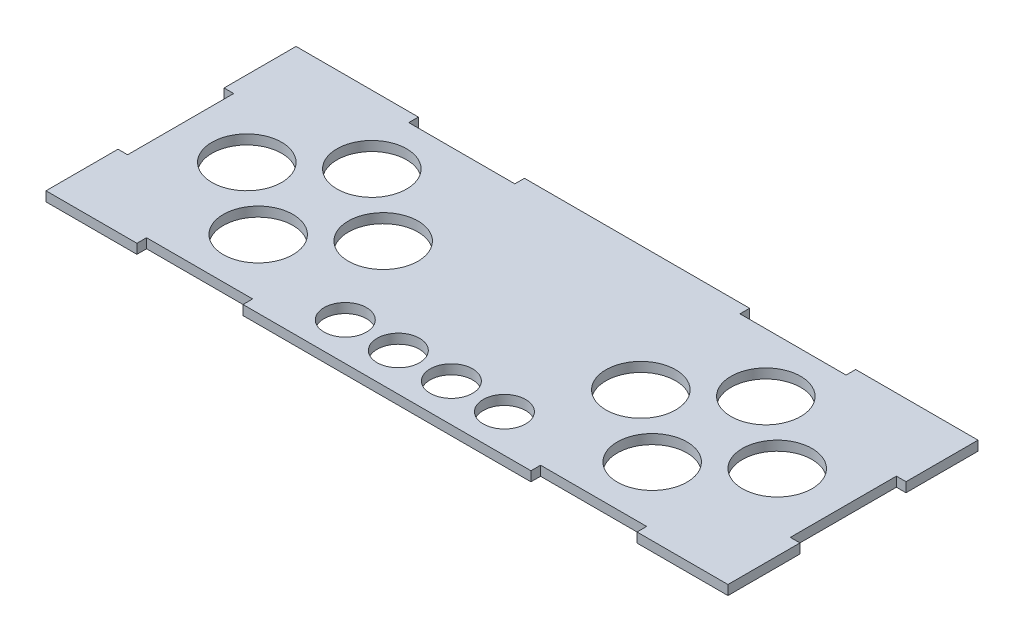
ISO-10303-21;
HEADER;
FILE_DESCRIPTION(('STEP AP214'),'2;1');
FILE_NAME('part.step','',(''),(''),'','','');
FILE_SCHEMA(('AUTOMOTIVE_DESIGN { 1 0 10303 214 1 1 1 1 }'));
ENDSEC;
DATA;
#1=APPLICATION_CONTEXT('core data for automotive mechanical design processes');
#2=APPLICATION_PROTOCOL_DEFINITION('international standard','automotive_design',2000,#1);
#3=PRODUCT_CONTEXT('',#1,'mechanical');
#4=PRODUCT('Part','Part','',(#3));
#5=PRODUCT_RELATED_PRODUCT_CATEGORY('part','',(#4));
#6=PRODUCT_DEFINITION_FORMATION('','',#4);
#7=PRODUCT_DEFINITION_CONTEXT('part definition',#1,'design');
#8=PRODUCT_DEFINITION('design','',#6,#7);
#9=PRODUCT_DEFINITION_SHAPE('','',#8);
#10=(LENGTH_UNIT() NAMED_UNIT(*) SI_UNIT(.MILLI.,.METRE.));
#11=(NAMED_UNIT(*) PLANE_ANGLE_UNIT() SI_UNIT($,.RADIAN.));
#12=(NAMED_UNIT(*) SI_UNIT($,.STERADIAN.) SOLID_ANGLE_UNIT());
#13=UNCERTAINTY_MEASURE_WITH_UNIT(LENGTH_MEASURE(1.E-05),#10,'distance_accuracy_value','');
#14=(GEOMETRIC_REPRESENTATION_CONTEXT(3) GLOBAL_UNCERTAINTY_ASSIGNED_CONTEXT((#13)) GLOBAL_UNIT_ASSIGNED_CONTEXT((#10,
#11,#12)) REPRESENTATION_CONTEXT('',''));
#15=CARTESIAN_POINT('',(0.,0.,0.));
#16=DIRECTION('',(0.,0.,1.));
#17=DIRECTION('',(1.,0.,0.));
#18=AXIS2_PLACEMENT_3D('',#15,#16,#17);
#19=CARTESIAN_POINT('',(0.,6.35,0.));
#20=DIRECTION('',(0.,-1.,0.));
#21=DIRECTION('',(0.,0.,-1.));
#22=AXIS2_PLACEMENT_3D('',#19,#20,#21);
#23=PLANE('',#22);
#24=DIRECTION('',(-1.,0.,0.));
#25=VECTOR('',#24,1.);
#26=CARTESIAN_POINT('',(-144.275,6.35,-82.5));
#27=LINE('',#26,#25);
#28=CARTESIAN_POINT('',(-144.275,6.35,-82.5));
#29=VERTEX_POINT('',#28);
#30=CARTESIAN_POINT('',(-225.,6.35,-82.5));
#31=VERTEX_POINT('',#30);
#32=EDGE_CURVE('E309',#29,#31,#27,.T.);
#33=ORIENTED_EDGE('',*,*,#32,.T.);
#34=DIRECTION('',(0.,0.,1.));
#35=VECTOR('',#34,1.);
#36=CARTESIAN_POINT('',(-225.,6.35,-35.));
#37=LINE('',#36,#35);
#38=CARTESIAN_POINT('',(-225.,6.35,-35.));
#39=VERTEX_POINT('',#38);
#40=EDGE_CURVE('E157',#31,#39,#37,.T.);
#41=ORIENTED_EDGE('',*,*,#40,.T.);
#42=DIRECTION('',(1.,0.,0.));
#43=VECTOR('',#42,1.);
#44=CARTESIAN_POINT('',(-225.,6.35,-35.));
#45=LINE('',#44,#43);
#46=CARTESIAN_POINT('',(-218.65,6.35,-35.));
#47=VERTEX_POINT('',#46);
#48=EDGE_CURVE('E384',#39,#47,#45,.T.);
#49=ORIENTED_EDGE('',*,*,#48,.T.);
#50=DIRECTION('',(0.,0.,1.));
#51=VECTOR('',#50,1.);
#52=CARTESIAN_POINT('',(-218.65,6.35,35.));
#53=LINE('',#52,#51);
#54=CARTESIAN_POINT('',(-218.65,6.35,35.));
#55=VERTEX_POINT('',#54);
#56=EDGE_CURVE('E403',#47,#55,#53,.T.);
#57=ORIENTED_EDGE('',*,*,#56,.T.);
#58=DIRECTION('',(-1.,0.,0.));
#59=VECTOR('',#58,1.);
#60=CARTESIAN_POINT('',(-225.,6.35,35.));
#61=LINE('',#60,#59);
#62=CARTESIAN_POINT('',(-225.,6.35,35.));
#63=VERTEX_POINT('',#62);
#64=EDGE_CURVE('E400',#55,#63,#61,.T.);
#65=ORIENTED_EDGE('',*,*,#64,.T.);
#66=DIRECTION('',(0.,0.,1.));
#67=VECTOR('',#66,1.);
#68=CARTESIAN_POINT('',(-225.,6.35,82.5));
#69=LINE('',#68,#67);
#70=CARTESIAN_POINT('',(-225.,6.35,82.5));
#71=VERTEX_POINT('',#70);
#72=EDGE_CURVE('E402',#63,#71,#69,.T.);
#73=ORIENTED_EDGE('',*,*,#72,.T.);
#74=DIRECTION('',(1.,0.,0.));
#75=VECTOR('',#74,1.);
#76=CARTESIAN_POINT('',(-165.,6.35,82.5));
#77=LINE('',#76,#75);
#78=CARTESIAN_POINT('',(-165.,6.35,82.5));
#79=VERTEX_POINT('',#78);
#80=EDGE_CURVE('E405',#71,#79,#77,.T.);
#81=ORIENTED_EDGE('',*,*,#80,.T.);
#82=DIRECTION('',(0.,0.,-1.));
#83=VECTOR('',#82,1.);
#84=CARTESIAN_POINT('',(-165.,6.35,82.5));
#85=LINE('',#84,#83);
#86=CARTESIAN_POINT('',(-165.,6.35,76.15));
#87=VERTEX_POINT('',#86);
#88=EDGE_CURVE('E411',#79,#87,#85,.T.);
#89=ORIENTED_EDGE('',*,*,#88,.T.);
#90=DIRECTION('',(1.,0.,0.));
#91=VECTOR('',#90,1.);
#92=CARTESIAN_POINT('',(-165.,6.35,76.15));
#93=LINE('',#92,#91);
#94=CARTESIAN_POINT('',(-95.,6.35,76.15));
#95=VERTEX_POINT('',#94);
#96=EDGE_CURVE('E413',#87,#95,#93,.T.);
#97=ORIENTED_EDGE('',*,*,#96,.T.);
#98=DIRECTION('',(0.,0.,1.));
#99=VECTOR('',#98,1.);
#100=CARTESIAN_POINT('',(-95.,6.35,82.5));
#101=LINE('',#100,#99);
#102=CARTESIAN_POINT('',(-95.,6.35,82.5));
#103=VERTEX_POINT('',#102);
#104=EDGE_CURVE('E415',#95,#103,#101,.T.);
#105=ORIENTED_EDGE('',*,*,#104,.T.);
#106=DIRECTION('',(1.,0.,0.));
#107=VECTOR('',#106,1.);
#108=CARTESIAN_POINT('',(95.,6.35,82.5));
#109=LINE('',#108,#107);
#110=CARTESIAN_POINT('',(95.,6.35,82.5));
#111=VERTEX_POINT('',#110);
#112=EDGE_CURVE('E417',#103,#111,#109,.T.);
#113=ORIENTED_EDGE('',*,*,#112,.T.);
#114=DIRECTION('',(0.,0.,-1.));
#115=VECTOR('',#114,1.);
#116=CARTESIAN_POINT('',(95.,6.35,82.5));
#117=LINE('',#116,#115);
#118=CARTESIAN_POINT('',(94.9999999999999,6.35,76.15));
#119=VERTEX_POINT('',#118);
#120=EDGE_CURVE('E419',#111,#119,#117,.T.);
#121=ORIENTED_EDGE('',*,*,#120,.T.);
#122=DIRECTION('',(1.,0.,0.));
#123=VECTOR('',#122,1.);
#124=CARTESIAN_POINT('',(94.9999999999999,6.35,76.15));
#125=LINE('',#124,#123);
#126=CARTESIAN_POINT('',(165.,6.35,76.15));
#127=VERTEX_POINT('',#126);
#128=EDGE_CURVE('E421',#119,#127,#125,.T.);
#129=ORIENTED_EDGE('',*,*,#128,.T.);
#130=DIRECTION('',(0.,0.,1.));
#131=VECTOR('',#130,1.);
#132=CARTESIAN_POINT('',(165.,6.35,82.5));
#133=LINE('',#132,#131);
#134=CARTESIAN_POINT('',(165.,6.35,82.5));
#135=VERTEX_POINT('',#134);
#136=EDGE_CURVE('E423',#127,#135,#133,.T.);
#137=ORIENTED_EDGE('',*,*,#136,.T.);
#138=DIRECTION('',(1.,0.,0.));
#139=VECTOR('',#138,1.);
#140=CARTESIAN_POINT('',(225.,6.35,82.5));
#141=LINE('',#140,#139);
#142=CARTESIAN_POINT('',(225.,6.35,82.5));
#143=VERTEX_POINT('',#142);
#144=EDGE_CURVE('E425',#135,#143,#141,.T.);
#145=ORIENTED_EDGE('',*,*,#144,.T.);
#146=DIRECTION('',(0.,0.,-1.));
#147=VECTOR('',#146,1.);
#148=CARTESIAN_POINT('',(225.,6.35,82.5));
#149=LINE('',#148,#147);
#150=CARTESIAN_POINT('',(225.,6.35,35.));
#151=VERTEX_POINT('',#150);
#152=EDGE_CURVE('E427',#143,#151,#149,.T.);
#153=ORIENTED_EDGE('',*,*,#152,.T.);
#154=DIRECTION('',(-1.,0.,0.));
#155=VECTOR('',#154,1.);
#156=CARTESIAN_POINT('',(225.,6.35,35.));
#157=LINE('',#156,#155);
#158=CARTESIAN_POINT('',(218.65,6.35,35.));
#159=VERTEX_POINT('',#158);
#160=EDGE_CURVE('E429',#151,#159,#157,.T.);
#161=ORIENTED_EDGE('',*,*,#160,.T.);
#162=DIRECTION('',(0.,0.,-1.));
#163=VECTOR('',#162,1.);
#164=CARTESIAN_POINT('',(218.65,6.35,35.));
#165=LINE('',#164,#163);
#166=CARTESIAN_POINT('',(218.65,6.35,-35.));
#167=VERTEX_POINT('',#166);
#168=EDGE_CURVE('E431',#159,#167,#165,.T.);
#169=ORIENTED_EDGE('',*,*,#168,.T.);
#170=DIRECTION('',(1.,0.,0.));
#171=VECTOR('',#170,1.);
#172=CARTESIAN_POINT('',(225.,6.35,-35.));
#173=LINE('',#172,#171);
#174=CARTESIAN_POINT('',(225.,6.35,-35.));
#175=VERTEX_POINT('',#174);
#176=EDGE_CURVE('E433',#167,#175,#173,.T.);
#177=ORIENTED_EDGE('',*,*,#176,.T.);
#178=DIRECTION('',(0.,0.,-1.));
#179=VECTOR('',#178,1.);
#180=CARTESIAN_POINT('',(225.,6.35,-35.));
#181=LINE('',#180,#179);
#182=CARTESIAN_POINT('',(225.,6.35,-82.5));
#183=VERTEX_POINT('',#182);
#184=EDGE_CURVE('E435',#175,#183,#181,.T.);
#185=ORIENTED_EDGE('',*,*,#184,.T.);
#186=DIRECTION('',(-1.,0.,0.));
#187=VECTOR('',#186,1.);
#188=CARTESIAN_POINT('',(225.,6.35,-82.5));
#189=LINE('',#188,#187);
#190=CARTESIAN_POINT('',(144.275,6.35,-82.5));
#191=VERTEX_POINT('',#190);
#192=EDGE_CURVE('E437',#183,#191,#189,.T.);
#193=ORIENTED_EDGE('',*,*,#192,.T.);
#194=DIRECTION('',(0.,0.,1.));
#195=VECTOR('',#194,1.);
#196=CARTESIAN_POINT('',(144.275,6.35,-82.5));
#197=LINE('',#196,#195);
#198=CARTESIAN_POINT('',(144.275,6.35,-76.15));
#199=VERTEX_POINT('',#198);
#200=EDGE_CURVE('E439',#191,#199,#197,.T.);
#201=ORIENTED_EDGE('',*,*,#200,.T.);
#202=DIRECTION('',(-1.,0.,0.));
#203=VECTOR('',#202,1.);
#204=CARTESIAN_POINT('',(74.275,6.35,-76.15));
#205=LINE('',#204,#203);
#206=CARTESIAN_POINT('',(74.275,6.35,-76.15));
#207=VERTEX_POINT('',#206);
#208=EDGE_CURVE('E441',#199,#207,#205,.T.);
#209=ORIENTED_EDGE('',*,*,#208,.T.);
#210=DIRECTION('',(0.,0.,-1.));
#211=VECTOR('',#210,1.);
#212=CARTESIAN_POINT('',(74.275,6.35,-82.5));
#213=LINE('',#212,#211);
#214=CARTESIAN_POINT('',(74.275,6.35,-82.5));
#215=VERTEX_POINT('',#214);
#216=EDGE_CURVE('E443',#207,#215,#213,.T.);
#217=ORIENTED_EDGE('',*,*,#216,.T.);
#218=DIRECTION('',(-1.,0.,0.));
#219=VECTOR('',#218,1.);
#220=CARTESIAN_POINT('',(74.275,6.35,-82.5));
#221=LINE('',#220,#219);
#222=CARTESIAN_POINT('',(-74.275,6.35,-82.5));
#223=VERTEX_POINT('',#222);
#224=EDGE_CURVE('E236',#215,#223,#221,.T.);
#225=ORIENTED_EDGE('',*,*,#224,.T.);
#226=DIRECTION('',(0.,0.,1.));
#227=VECTOR('',#226,1.);
#228=CARTESIAN_POINT('',(-74.275,6.35,-82.5));
#229=LINE('',#228,#227);
#230=CARTESIAN_POINT('',(-74.275,6.35,-76.15));
#231=VERTEX_POINT('',#230);
#232=EDGE_CURVE('E230',#223,#231,#229,.T.);
#233=ORIENTED_EDGE('',*,*,#232,.T.);
#234=DIRECTION('',(-1.,0.,0.));
#235=VECTOR('',#234,1.);
#236=CARTESIAN_POINT('',(-144.275,6.35,-76.15));
#237=LINE('',#236,#235);
#238=CARTESIAN_POINT('',(-144.275,6.35,-76.15));
#239=VERTEX_POINT('',#238);
#240=EDGE_CURVE('E234',#231,#239,#237,.T.);
#241=ORIENTED_EDGE('',*,*,#240,.T.);
#242=DIRECTION('',(0.,0.,-1.));
#243=VECTOR('',#242,1.);
#244=CARTESIAN_POINT('',(-144.275,6.35,-82.5));
#245=LINE('',#244,#243);
#246=EDGE_CURVE('E54',#239,#29,#245,.T.);
#247=ORIENTED_EDGE('',*,*,#246,.T.);
#248=EDGE_LOOP('',(#33,#41,#49,#57,#65,#73,#81,#89,#97,#105,#113,#121,#129,#137,#145,#153,#161,
#169,#177,#185,#193,#201,#209,#217,#225,#233,#241,#247));
#249=FACE_BOUND('',#248,.T.);
#250=CARTESIAN_POINT('',(-130.,6.35,-37.5));
#251=DIRECTION('',(0.,1.,0.));
#252=DIRECTION('',(0.,0.,1.));
#253=AXIS2_PLACEMENT_3D('',#250,#251,#252);
#254=CIRCLE('',#253,23.);
#255=CARTESIAN_POINT('',(-130.,6.35,-14.5));
#256=VERTEX_POINT('',#255);
#257=EDGE_CURVE('E258',#256,#256,#254,.T.);
#258=ORIENTED_EDGE('',*,*,#257,.F.);
#259=EDGE_LOOP('',(#258));
#260=FACE_BOUND('',#259,.T.);
#261=CARTESIAN_POINT('',(-85.,6.35,0.));
#262=DIRECTION('',(0.,1.,0.));
#263=DIRECTION('',(0.,0.,1.));
#264=AXIS2_PLACEMENT_3D('',#261,#262,#263);
#265=CIRCLE('',#264,23.);
#266=CARTESIAN_POINT('',(-85.,6.35,23.));
#267=VERTEX_POINT('',#266);
#268=EDGE_CURVE('E587',#267,#267,#265,.T.);
#269=ORIENTED_EDGE('',*,*,#268,.F.);
#270=EDGE_LOOP('',(#269));
#271=FACE_BOUND('',#270,.T.);
#272=CARTESIAN_POINT('',(-175.,6.35,0.));
#273=DIRECTION('',(0.,1.,0.));
#274=DIRECTION('',(0.,0.,1.));
#275=AXIS2_PLACEMENT_3D('',#272,#273,#274);
#276=CIRCLE('',#275,23.);
#277=CARTESIAN_POINT('',(-175.,6.35,23.));
#278=VERTEX_POINT('',#277);
#279=EDGE_CURVE('E581',#278,#278,#276,.T.);
#280=ORIENTED_EDGE('',*,*,#279,.F.);
#281=EDGE_LOOP('',(#280));
#282=FACE_BOUND('',#281,.T.);
#283=CARTESIAN_POINT('',(-130.,6.35,37.5));
#284=DIRECTION('',(0.,1.,0.));
#285=DIRECTION('',(0.,0.,1.));
#286=AXIS2_PLACEMENT_3D('',#283,#284,#285);
#287=CIRCLE('',#286,23.);
#288=CARTESIAN_POINT('',(-130.,6.35,60.5));
#289=VERTEX_POINT('',#288);
#290=EDGE_CURVE('E575',#289,#289,#287,.T.);
#291=ORIENTED_EDGE('',*,*,#290,.F.);
#292=EDGE_LOOP('',(#291));
#293=FACE_BOUND('',#292,.T.);
#294=CARTESIAN_POINT('',(130.,6.35,-37.5));
#295=DIRECTION('',(0.,1.,0.));
#296=DIRECTION('',(0.,0.,1.));
#297=AXIS2_PLACEMENT_3D('',#294,#295,#296);
#298=CIRCLE('',#297,23.);
#299=CARTESIAN_POINT('',(130.,6.35,-14.5000000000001));
#300=VERTEX_POINT('',#299);
#301=EDGE_CURVE('E569',#300,#300,#298,.T.);
#302=ORIENTED_EDGE('',*,*,#301,.F.);
#303=EDGE_LOOP('',(#302));
#304=FACE_BOUND('',#303,.T.);
#305=CARTESIAN_POINT('',(85.,6.35,0.));
#306=DIRECTION('',(0.,1.,0.));
#307=DIRECTION('',(0.,0.,1.));
#308=AXIS2_PLACEMENT_3D('',#305,#306,#307);
#309=CIRCLE('',#308,23.);
#310=CARTESIAN_POINT('',(85.,6.35,23.));
#311=VERTEX_POINT('',#310);
#312=EDGE_CURVE('E563',#311,#311,#309,.T.);
#313=ORIENTED_EDGE('',*,*,#312,.F.);
#314=EDGE_LOOP('',(#313));
#315=FACE_BOUND('',#314,.T.);
#316=CARTESIAN_POINT('',(175.,6.35,0.));
#317=DIRECTION('',(0.,1.,0.));
#318=DIRECTION('',(0.,0.,1.));
#319=AXIS2_PLACEMENT_3D('',#316,#317,#318);
#320=CIRCLE('',#319,23.);
#321=CARTESIAN_POINT('',(175.,6.35,23.));
#322=VERTEX_POINT('',#321);
#323=EDGE_CURVE('E557',#322,#322,#320,.T.);
#324=ORIENTED_EDGE('',*,*,#323,.F.);
#325=EDGE_LOOP('',(#324));
#326=FACE_BOUND('',#325,.T.);
#327=CARTESIAN_POINT('',(130.,6.35,37.5));
#328=DIRECTION('',(0.,1.,0.));
#329=DIRECTION('',(0.,0.,1.));
#330=AXIS2_PLACEMENT_3D('',#327,#328,#329);
#331=CIRCLE('',#330,23.);
#332=CARTESIAN_POINT('',(130.,6.35,60.5));
#333=VERTEX_POINT('',#332);
#334=EDGE_CURVE('E551',#333,#333,#331,.T.);
#335=ORIENTED_EDGE('',*,*,#334,.F.);
#336=EDGE_LOOP('',(#335));
#337=FACE_BOUND('',#336,.T.);
#338=CARTESIAN_POINT('',(-52.5,6.35,57.5));
#339=DIRECTION('',(0.,1.,0.));
#340=DIRECTION('',(0.,0.,1.));
#341=AXIS2_PLACEMENT_3D('',#338,#339,#340);
#342=CIRCLE('',#341,14.);
#343=CARTESIAN_POINT('',(-52.5,6.35,71.5));
#344=VERTEX_POINT('',#343);
#345=EDGE_CURVE('E545',#344,#344,#342,.T.);
#346=ORIENTED_EDGE('',*,*,#345,.F.);
#347=EDGE_LOOP('',(#346));
#348=FACE_BOUND('',#347,.T.);
#349=CARTESIAN_POINT('',(-17.5,6.35,57.5));
#350=DIRECTION('',(0.,1.,0.));
#351=DIRECTION('',(0.,0.,1.));
#352=AXIS2_PLACEMENT_3D('',#349,#350,#351);
#353=CIRCLE('',#352,14.);
#354=CARTESIAN_POINT('',(-17.5,6.35,71.5));
#355=VERTEX_POINT('',#354);
#356=EDGE_CURVE('E539',#355,#355,#353,.T.);
#357=ORIENTED_EDGE('',*,*,#356,.F.);
#358=EDGE_LOOP('',(#357));
#359=FACE_BOUND('',#358,.T.);
#360=CARTESIAN_POINT('',(17.5,6.35,57.5));
#361=DIRECTION('',(0.,1.,0.));
#362=DIRECTION('',(0.,0.,1.));
#363=AXIS2_PLACEMENT_3D('',#360,#361,#362);
#364=CIRCLE('',#363,14.);
#365=CARTESIAN_POINT('',(17.5,6.35,71.5));
#366=VERTEX_POINT('',#365);
#367=EDGE_CURVE('E533',#366,#366,#364,.T.);
#368=ORIENTED_EDGE('',*,*,#367,.F.);
#369=EDGE_LOOP('',(#368));
#370=FACE_BOUND('',#369,.T.);
#371=CARTESIAN_POINT('',(52.5,6.35,57.5));
#372=DIRECTION('',(0.,1.,0.));
#373=DIRECTION('',(0.,0.,1.));
#374=AXIS2_PLACEMENT_3D('',#371,#372,#373);
#375=CIRCLE('',#374,14.);
#376=CARTESIAN_POINT('',(52.5,6.35,71.5));
#377=VERTEX_POINT('',#376);
#378=EDGE_CURVE('E524',#377,#377,#375,.T.);
#379=ORIENTED_EDGE('',*,*,#378,.F.);
#380=EDGE_LOOP('',(#379));
#381=FACE_BOUND('',#380,.T.);
#382=ADVANCED_FACE('F37',(#249,#260,#271,#282,#293,#304,#315,#326,#337,#348,#359,#370,#381),#23,.F.);
#383=CARTESIAN_POINT('',(0.,0.,0.));
#384=DIRECTION('',(0.,-1.,0.));
#385=DIRECTION('',(0.,0.,-1.));
#386=AXIS2_PLACEMENT_3D('',#383,#384,#385);
#387=PLANE('',#386);
#388=CARTESIAN_POINT('',(17.5,0.,57.5));
#389=DIRECTION('',(0.,1.,0.));
#390=DIRECTION('',(0.,0.,1.));
#391=AXIS2_PLACEMENT_3D('',#388,#389,#390);
#392=CIRCLE('',#391,14.);
#393=CARTESIAN_POINT('',(17.5,0.,71.5));
#394=VERTEX_POINT('',#393);
#395=EDGE_CURVE('E530',#394,#394,#392,.T.);
#396=ORIENTED_EDGE('',*,*,#395,.T.);
#397=EDGE_LOOP('',(#396));
#398=FACE_BOUND('',#397,.T.);
#399=CARTESIAN_POINT('',(-52.5,0.,57.5));
#400=DIRECTION('',(0.,1.,0.));
#401=DIRECTION('',(0.,0.,1.));
#402=AXIS2_PLACEMENT_3D('',#399,#400,#401);
#403=CIRCLE('',#402,14.);
#404=CARTESIAN_POINT('',(-52.5,0.,71.5));
#405=VERTEX_POINT('',#404);
#406=EDGE_CURVE('E542',#405,#405,#403,.T.);
#407=ORIENTED_EDGE('',*,*,#406,.T.);
#408=EDGE_LOOP('',(#407));
#409=FACE_BOUND('',#408,.T.);
#410=CARTESIAN_POINT('',(175.,0.,0.));
#411=DIRECTION('',(0.,1.,0.));
#412=DIRECTION('',(0.,0.,1.));
#413=AXIS2_PLACEMENT_3D('',#410,#411,#412);
#414=CIRCLE('',#413,23.);
#415=CARTESIAN_POINT('',(175.,0.,23.));
#416=VERTEX_POINT('',#415);
#417=EDGE_CURVE('E554',#416,#416,#414,.T.);
#418=ORIENTED_EDGE('',*,*,#417,.T.);
#419=EDGE_LOOP('',(#418));
#420=FACE_BOUND('',#419,.T.);
#421=CARTESIAN_POINT('',(130.,0.,-37.5));
#422=DIRECTION('',(0.,1.,0.));
#423=DIRECTION('',(0.,0.,1.));
#424=AXIS2_PLACEMENT_3D('',#421,#422,#423);
#425=CIRCLE('',#424,23.);
#426=CARTESIAN_POINT('',(130.,0.,-14.5000000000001));
#427=VERTEX_POINT('',#426);
#428=EDGE_CURVE('E566',#427,#427,#425,.T.);
#429=ORIENTED_EDGE('',*,*,#428,.T.);
#430=EDGE_LOOP('',(#429));
#431=FACE_BOUND('',#430,.T.);
#432=CARTESIAN_POINT('',(-175.,0.,0.));
#433=DIRECTION('',(0.,1.,0.));
#434=DIRECTION('',(0.,0.,1.));
#435=AXIS2_PLACEMENT_3D('',#432,#433,#434);
#436=CIRCLE('',#435,23.);
#437=CARTESIAN_POINT('',(-175.,0.,23.));
#438=VERTEX_POINT('',#437);
#439=EDGE_CURVE('E578',#438,#438,#436,.T.);
#440=ORIENTED_EDGE('',*,*,#439,.T.);
#441=EDGE_LOOP('',(#440));
#442=FACE_BOUND('',#441,.T.);
#443=CARTESIAN_POINT('',(-130.,0.,-37.5));
#444=DIRECTION('',(0.,1.,0.));
#445=DIRECTION('',(0.,0.,1.));
#446=AXIS2_PLACEMENT_3D('',#443,#444,#445);
#447=CIRCLE('',#446,23.);
#448=CARTESIAN_POINT('',(-130.,0.,-14.5));
#449=VERTEX_POINT('',#448);
#450=EDGE_CURVE('E590',#449,#449,#447,.T.);
#451=ORIENTED_EDGE('',*,*,#450,.T.);
#452=EDGE_LOOP('',(#451));
#453=FACE_BOUND('',#452,.T.);
#454=DIRECTION('',(-1.,0.,0.));
#455=VECTOR('',#454,1.);
#456=CARTESIAN_POINT('',(-144.275,0.,-82.5));
#457=LINE('',#456,#455);
#458=CARTESIAN_POINT('',(-144.275,0.,-82.5));
#459=VERTEX_POINT('',#458);
#460=CARTESIAN_POINT('',(-225.,0.,-82.5));
#461=VERTEX_POINT('',#460);
#462=EDGE_CURVE('E254',#459,#461,#457,.T.);
#463=ORIENTED_EDGE('',*,*,#462,.F.);
#464=DIRECTION('',(0.,0.,-1.));
#465=VECTOR('',#464,1.);
#466=CARTESIAN_POINT('',(-144.275,0.,-82.5));
#467=LINE('',#466,#465);
#468=CARTESIAN_POINT('',(-144.275,0.,-76.15));
#469=VERTEX_POINT('',#468);
#470=EDGE_CURVE('E149',#469,#459,#467,.T.);
#471=ORIENTED_EDGE('',*,*,#470,.F.);
#472=DIRECTION('',(-1.,0.,0.));
#473=VECTOR('',#472,1.);
#474=CARTESIAN_POINT('',(-144.275,0.,-76.15));
#475=LINE('',#474,#473);
#476=CARTESIAN_POINT('',(-74.275,0.,-76.15));
#477=VERTEX_POINT('',#476);
#478=EDGE_CURVE('E143',#477,#469,#475,.T.);
#479=ORIENTED_EDGE('',*,*,#478,.F.);
#480=DIRECTION('',(0.,0.,1.));
#481=VECTOR('',#480,1.);
#482=CARTESIAN_POINT('',(-74.275,0.,-82.5));
#483=LINE('',#482,#481);
#484=CARTESIAN_POINT('',(-74.275,0.,-82.5));
#485=VERTEX_POINT('',#484);
#486=EDGE_CURVE('E244',#485,#477,#483,.T.);
#487=ORIENTED_EDGE('',*,*,#486,.F.);
#488=DIRECTION('',(-1.,0.,0.));
#489=VECTOR('',#488,1.);
#490=CARTESIAN_POINT('',(74.275,0.,-82.5));
#491=LINE('',#490,#489);
#492=CARTESIAN_POINT('',(74.275,0.,-82.5));
#493=VERTEX_POINT('',#492);
#494=EDGE_CURVE('E304',#493,#485,#491,.T.);
#495=ORIENTED_EDGE('',*,*,#494,.F.);
#496=DIRECTION('',(0.,0.,-1.));
#497=VECTOR('',#496,1.);
#498=CARTESIAN_POINT('',(74.275,0.,-82.5));
#499=LINE('',#498,#497);
#500=CARTESIAN_POINT('',(74.275,0.,-76.15));
#501=VERTEX_POINT('',#500);
#502=EDGE_CURVE('E302',#501,#493,#499,.T.);
#503=ORIENTED_EDGE('',*,*,#502,.F.);
#504=DIRECTION('',(-1.,0.,0.));
#505=VECTOR('',#504,1.);
#506=CARTESIAN_POINT('',(74.275,0.,-76.15));
#507=LINE('',#506,#505);
#508=CARTESIAN_POINT('',(144.275,0.,-76.15));
#509=VERTEX_POINT('',#508);
#510=EDGE_CURVE('E300',#509,#501,#507,.T.);
#511=ORIENTED_EDGE('',*,*,#510,.F.);
#512=DIRECTION('',(0.,0.,1.));
#513=VECTOR('',#512,1.);
#514=CARTESIAN_POINT('',(144.275,0.,-82.5));
#515=LINE('',#514,#513);
#516=CARTESIAN_POINT('',(144.275,0.,-82.5));
#517=VERTEX_POINT('',#516);
#518=EDGE_CURVE('E298',#517,#509,#515,.T.);
#519=ORIENTED_EDGE('',*,*,#518,.F.);
#520=DIRECTION('',(-1.,0.,0.));
#521=VECTOR('',#520,1.);
#522=CARTESIAN_POINT('',(225.,0.,-82.5));
#523=LINE('',#522,#521);
#524=CARTESIAN_POINT('',(225.,0.,-82.5));
#525=VERTEX_POINT('',#524);
#526=EDGE_CURVE('E296',#525,#517,#523,.T.);
#527=ORIENTED_EDGE('',*,*,#526,.F.);
#528=DIRECTION('',(0.,0.,-1.));
#529=VECTOR('',#528,1.);
#530=CARTESIAN_POINT('',(225.,0.,-35.));
#531=LINE('',#530,#529);
#532=CARTESIAN_POINT('',(225.,0.,-35.));
#533=VERTEX_POINT('',#532);
#534=EDGE_CURVE('E294',#533,#525,#531,.T.);
#535=ORIENTED_EDGE('',*,*,#534,.F.);
#536=DIRECTION('',(1.,0.,0.));
#537=VECTOR('',#536,1.);
#538=CARTESIAN_POINT('',(225.,0.,-35.));
#539=LINE('',#538,#537);
#540=CARTESIAN_POINT('',(218.65,0.,-35.));
#541=VERTEX_POINT('',#540);
#542=EDGE_CURVE('E292',#541,#533,#539,.T.);
#543=ORIENTED_EDGE('',*,*,#542,.F.);
#544=DIRECTION('',(0.,0.,-1.));
#545=VECTOR('',#544,1.);
#546=CARTESIAN_POINT('',(218.65,0.,35.));
#547=LINE('',#546,#545);
#548=CARTESIAN_POINT('',(218.65,0.,35.));
#549=VERTEX_POINT('',#548);
#550=EDGE_CURVE('E290',#549,#541,#547,.T.);
#551=ORIENTED_EDGE('',*,*,#550,.F.);
#552=DIRECTION('',(-1.,0.,0.));
#553=VECTOR('',#552,1.);
#554=CARTESIAN_POINT('',(225.,0.,35.));
#555=LINE('',#554,#553);
#556=CARTESIAN_POINT('',(225.,0.,35.));
#557=VERTEX_POINT('',#556);
#558=EDGE_CURVE('E288',#557,#549,#555,.T.);
#559=ORIENTED_EDGE('',*,*,#558,.F.);
#560=DIRECTION('',(0.,0.,-1.));
#561=VECTOR('',#560,1.);
#562=CARTESIAN_POINT('',(225.,0.,82.5));
#563=LINE('',#562,#561);
#564=CARTESIAN_POINT('',(225.,0.,82.5));
#565=VERTEX_POINT('',#564);
#566=EDGE_CURVE('E286',#565,#557,#563,.T.);
#567=ORIENTED_EDGE('',*,*,#566,.F.);
#568=DIRECTION('',(1.,0.,0.));
#569=VECTOR('',#568,1.);
#570=CARTESIAN_POINT('',(225.,0.,82.5));
#571=LINE('',#570,#569);
#572=CARTESIAN_POINT('',(165.,0.,82.5));
#573=VERTEX_POINT('',#572);
#574=EDGE_CURVE('E284',#573,#565,#571,.T.);
#575=ORIENTED_EDGE('',*,*,#574,.F.);
#576=DIRECTION('',(0.,0.,1.));
#577=VECTOR('',#576,1.);
#578=CARTESIAN_POINT('',(165.,0.,82.5));
#579=LINE('',#578,#577);
#580=CARTESIAN_POINT('',(165.,0.,76.15));
#581=VERTEX_POINT('',#580);
#582=EDGE_CURVE('E282',#581,#573,#579,.T.);
#583=ORIENTED_EDGE('',*,*,#582,.F.);
#584=DIRECTION('',(1.,0.,0.));
#585=VECTOR('',#584,1.);
#586=CARTESIAN_POINT('',(94.9999999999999,0.,76.15));
#587=LINE('',#586,#585);
#588=CARTESIAN_POINT('',(94.9999999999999,0.,76.15));
#589=VERTEX_POINT('',#588);
#590=EDGE_CURVE('E280',#589,#581,#587,.T.);
#591=ORIENTED_EDGE('',*,*,#590,.F.);
#592=DIRECTION('',(0.,0.,-1.));
#593=VECTOR('',#592,1.);
#594=CARTESIAN_POINT('',(95.,0.,82.5));
#595=LINE('',#594,#593);
#596=CARTESIAN_POINT('',(95.,0.,82.5));
#597=VERTEX_POINT('',#596);
#598=EDGE_CURVE('E278',#597,#589,#595,.T.);
#599=ORIENTED_EDGE('',*,*,#598,.F.);
#600=DIRECTION('',(1.,0.,0.));
#601=VECTOR('',#600,1.);
#602=CARTESIAN_POINT('',(95.,0.,82.5));
#603=LINE('',#602,#601);
#604=CARTESIAN_POINT('',(-95.,0.,82.5));
#605=VERTEX_POINT('',#604);
#606=EDGE_CURVE('E276',#605,#597,#603,.T.);
#607=ORIENTED_EDGE('',*,*,#606,.F.);
#608=DIRECTION('',(0.,0.,1.));
#609=VECTOR('',#608,1.);
#610=CARTESIAN_POINT('',(-95.,0.,82.5));
#611=LINE('',#610,#609);
#612=CARTESIAN_POINT('',(-95.,0.,76.15));
#613=VERTEX_POINT('',#612);
#614=EDGE_CURVE('E274',#613,#605,#611,.T.);
#615=ORIENTED_EDGE('',*,*,#614,.F.);
#616=DIRECTION('',(1.,0.,0.));
#617=VECTOR('',#616,1.);
#618=CARTESIAN_POINT('',(-165.,0.,76.15));
#619=LINE('',#618,#617);
#620=CARTESIAN_POINT('',(-165.,0.,76.15));
#621=VERTEX_POINT('',#620);
#622=EDGE_CURVE('E272',#621,#613,#619,.T.);
#623=ORIENTED_EDGE('',*,*,#622,.F.);
#624=DIRECTION('',(0.,0.,-1.));
#625=VECTOR('',#624,1.);
#626=CARTESIAN_POINT('',(-165.,0.,82.5));
#627=LINE('',#626,#625);
#628=CARTESIAN_POINT('',(-165.,0.,82.5));
#629=VERTEX_POINT('',#628);
#630=EDGE_CURVE('E270',#629,#621,#627,.T.);
#631=ORIENTED_EDGE('',*,*,#630,.F.);
#632=DIRECTION('',(1.,0.,0.));
#633=VECTOR('',#632,1.);
#634=CARTESIAN_POINT('',(-165.,0.,82.5));
#635=LINE('',#634,#633);
#636=CARTESIAN_POINT('',(-225.,0.,82.5));
#637=VERTEX_POINT('',#636);
#638=EDGE_CURVE('E268',#637,#629,#635,.T.);
#639=ORIENTED_EDGE('',*,*,#638,.F.);
#640=DIRECTION('',(0.,0.,1.));
#641=VECTOR('',#640,1.);
#642=CARTESIAN_POINT('',(-225.,0.,82.5));
#643=LINE('',#642,#641);
#644=CARTESIAN_POINT('',(-225.,0.,35.));
#645=VERTEX_POINT('',#644);
#646=EDGE_CURVE('E266',#645,#637,#643,.T.);
#647=ORIENTED_EDGE('',*,*,#646,.F.);
#648=DIRECTION('',(-1.,0.,0.));
#649=VECTOR('',#648,1.);
#650=CARTESIAN_POINT('',(-225.,0.,35.));
#651=LINE('',#650,#649);
#652=CARTESIAN_POINT('',(-218.65,0.,35.));
#653=VERTEX_POINT('',#652);
#654=EDGE_CURVE('E264',#653,#645,#651,.T.);
#655=ORIENTED_EDGE('',*,*,#654,.F.);
#656=DIRECTION('',(0.,0.,1.));
#657=VECTOR('',#656,1.);
#658=CARTESIAN_POINT('',(-218.65,0.,35.));
#659=LINE('',#658,#657);
#660=CARTESIAN_POINT('',(-218.65,0.,-35.));
#661=VERTEX_POINT('',#660);
#662=EDGE_CURVE('E262',#661,#653,#659,.T.);
#663=ORIENTED_EDGE('',*,*,#662,.F.);
#664=DIRECTION('',(1.,0.,0.));
#665=VECTOR('',#664,1.);
#666=CARTESIAN_POINT('',(-225.,0.,-35.));
#667=LINE('',#666,#665);
#668=CARTESIAN_POINT('',(-225.,0.,-35.));
#669=VERTEX_POINT('',#668);
#670=EDGE_CURVE('E260',#669,#661,#667,.T.);
#671=ORIENTED_EDGE('',*,*,#670,.F.);
#672=DIRECTION('',(0.,0.,1.));
#673=VECTOR('',#672,1.);
#674=CARTESIAN_POINT('',(-225.,0.,-35.));
#675=LINE('',#674,#673);
#676=EDGE_CURVE('E257',#461,#669,#675,.T.);
#677=ORIENTED_EDGE('',*,*,#676,.F.);
#678=EDGE_LOOP('',(#463,#471,#479,#487,#495,#503,#511,#519,#527,#535,#543,#551,#559,#567,#575,
#583,#591,#599,#607,#615,#623,#631,#639,#647,#655,#663,#671,#677));
#679=FACE_BOUND('',#678,.T.);
#680=CARTESIAN_POINT('',(-85.,0.,0.));
#681=DIRECTION('',(0.,1.,0.));
#682=DIRECTION('',(0.,0.,1.));
#683=AXIS2_PLACEMENT_3D('',#680,#681,#682);
#684=CIRCLE('',#683,23.);
#685=CARTESIAN_POINT('',(-85.,0.,23.));
#686=VERTEX_POINT('',#685);
#687=EDGE_CURVE('E584',#686,#686,#684,.T.);
#688=ORIENTED_EDGE('',*,*,#687,.T.);
#689=EDGE_LOOP('',(#688));
#690=FACE_BOUND('',#689,.T.);
#691=CARTESIAN_POINT('',(-130.,0.,37.5));
#692=DIRECTION('',(0.,1.,0.));
#693=DIRECTION('',(0.,0.,1.));
#694=AXIS2_PLACEMENT_3D('',#691,#692,#693);
#695=CIRCLE('',#694,23.);
#696=CARTESIAN_POINT('',(-130.,0.,60.5));
#697=VERTEX_POINT('',#696);
#698=EDGE_CURVE('E572',#697,#697,#695,.T.);
#699=ORIENTED_EDGE('',*,*,#698,.T.);
#700=EDGE_LOOP('',(#699));
#701=FACE_BOUND('',#700,.T.);
#702=CARTESIAN_POINT('',(85.,0.,0.));
#703=DIRECTION('',(0.,1.,0.));
#704=DIRECTION('',(0.,0.,1.));
#705=AXIS2_PLACEMENT_3D('',#702,#703,#704);
#706=CIRCLE('',#705,23.);
#707=CARTESIAN_POINT('',(85.,0.,23.));
#708=VERTEX_POINT('',#707);
#709=EDGE_CURVE('E560',#708,#708,#706,.T.);
#710=ORIENTED_EDGE('',*,*,#709,.T.);
#711=EDGE_LOOP('',(#710));
#712=FACE_BOUND('',#711,.T.);
#713=CARTESIAN_POINT('',(130.,0.,37.5));
#714=DIRECTION('',(0.,1.,0.));
#715=DIRECTION('',(0.,0.,1.));
#716=AXIS2_PLACEMENT_3D('',#713,#714,#715);
#717=CIRCLE('',#716,23.);
#718=CARTESIAN_POINT('',(130.,0.,60.5));
#719=VERTEX_POINT('',#718);
#720=EDGE_CURVE('E548',#719,#719,#717,.T.);
#721=ORIENTED_EDGE('',*,*,#720,.T.);
#722=EDGE_LOOP('',(#721));
#723=FACE_BOUND('',#722,.T.);
#724=CARTESIAN_POINT('',(-17.5,0.,57.5));
#725=DIRECTION('',(0.,1.,0.));
#726=DIRECTION('',(0.,0.,1.));
#727=AXIS2_PLACEMENT_3D('',#724,#725,#726);
#728=CIRCLE('',#727,14.);
#729=CARTESIAN_POINT('',(-17.5,0.,71.5));
#730=VERTEX_POINT('',#729);
#731=EDGE_CURVE('E536',#730,#730,#728,.T.);
#732=ORIENTED_EDGE('',*,*,#731,.T.);
#733=EDGE_LOOP('',(#732));
#734=FACE_BOUND('',#733,.T.);
#735=CARTESIAN_POINT('',(52.5,0.,57.5));
#736=DIRECTION('',(0.,1.,0.));
#737=DIRECTION('',(0.,0.,1.));
#738=AXIS2_PLACEMENT_3D('',#735,#736,#737);
#739=CIRCLE('',#738,14.);
#740=CARTESIAN_POINT('',(52.5,0.,71.5));
#741=VERTEX_POINT('',#740);
#742=EDGE_CURVE('E527',#741,#741,#739,.T.);
#743=ORIENTED_EDGE('',*,*,#742,.T.);
#744=EDGE_LOOP('',(#743));
#745=FACE_BOUND('',#744,.T.);
#746=ADVANCED_FACE('F388',(#398,#409,#420,#431,#442,#453,#679,#690,#701,#712,#723,#734,#745),
#387,.T.);
#747=CARTESIAN_POINT('',(-144.275,6.35,-82.5));
#748=DIRECTION('',(0.,0.,1.));
#749=DIRECTION('',(1.,0.,0.));
#750=AXIS2_PLACEMENT_3D('',#747,#748,#749);
#751=PLANE('',#750);
#752=ORIENTED_EDGE('',*,*,#462,.T.);
#753=DIRECTION('',(0.,-1.,0.));
#754=VECTOR('',#753,1.);
#755=CARTESIAN_POINT('',(-225.,6.35,-82.5));
#756=LINE('',#755,#754);
#757=EDGE_CURVE('E11',#31,#461,#756,.T.);
#758=ORIENTED_EDGE('',*,*,#757,.F.);
#759=ORIENTED_EDGE('',*,*,#32,.F.);
#760=DIRECTION('',(0.,-1.,0.));
#761=VECTOR('',#760,1.);
#762=CARTESIAN_POINT('',(-144.275,6.35,-82.5));
#763=LINE('',#762,#761);
#764=EDGE_CURVE('E250',#29,#459,#763,.T.);
#765=ORIENTED_EDGE('',*,*,#764,.T.);
#766=EDGE_LOOP('',(#752,#758,#759,#765));
#767=FACE_BOUND('',#766,.T.);
#768=ADVANCED_FACE('F39',(#767),#751,.F.);
#769=CARTESIAN_POINT('',(-225.,6.35,-35.));
#770=DIRECTION('',(1.,0.,0.));
#771=DIRECTION('',(0.,0.,-1.));
#772=AXIS2_PLACEMENT_3D('',#769,#770,#771);
#773=PLANE('',#772);
#774=ORIENTED_EDGE('',*,*,#676,.T.);
#775=DIRECTION('',(0.,-1.,0.));
#776=VECTOR('',#775,1.);
#777=CARTESIAN_POINT('',(-225.,6.35,-35.));
#778=LINE('',#777,#776);
#779=EDGE_CURVE('E46',#39,#669,#778,.T.);
#780=ORIENTED_EDGE('',*,*,#779,.F.);
#781=ORIENTED_EDGE('',*,*,#40,.F.);
#782=ORIENTED_EDGE('',*,*,#757,.T.);
#783=EDGE_LOOP('',(#774,#780,#781,#782));
#784=FACE_BOUND('',#783,.T.);
#785=ADVANCED_FACE('F960',(#784),#773,.F.);
#786=CARTESIAN_POINT('',(-225.,6.35,-35.));
#787=DIRECTION('',(0.,0.,-1.));
#788=DIRECTION('',(-1.,0.,0.));
#789=AXIS2_PLACEMENT_3D('',#786,#787,#788);
#790=PLANE('',#789);
#791=ORIENTED_EDGE('',*,*,#670,.T.);
#792=DIRECTION('',(0.,-1.,0.));
#793=VECTOR('',#792,1.);
#794=CARTESIAN_POINT('',(-218.65,6.35,-35.));
#795=LINE('',#794,#793);
#796=EDGE_CURVE('E376',#47,#661,#795,.T.);
#797=ORIENTED_EDGE('',*,*,#796,.F.);
#798=ORIENTED_EDGE('',*,*,#48,.F.);
#799=ORIENTED_EDGE('',*,*,#779,.T.);
#800=EDGE_LOOP('',(#791,#797,#798,#799));
#801=FACE_BOUND('',#800,.T.);
#802=ADVANCED_FACE('F382',(#801),#790,.F.);
#803=CARTESIAN_POINT('',(-218.65,6.35,35.));
#804=DIRECTION('',(1.,0.,0.));
#805=DIRECTION('',(0.,0.,-1.));
#806=AXIS2_PLACEMENT_3D('',#803,#804,#805);
#807=PLANE('',#806);
#808=ORIENTED_EDGE('',*,*,#662,.T.);
#809=DIRECTION('',(0.,-1.,0.));
#810=VECTOR('',#809,1.);
#811=CARTESIAN_POINT('',(-218.65,6.35,35.));
#812=LINE('',#811,#810);
#813=EDGE_CURVE('E373',#55,#653,#812,.T.);
#814=ORIENTED_EDGE('',*,*,#813,.F.);
#815=ORIENTED_EDGE('',*,*,#56,.F.);
#816=ORIENTED_EDGE('',*,*,#796,.T.);
#817=EDGE_LOOP('',(#808,#814,#815,#816));
#818=FACE_BOUND('',#817,.T.);
#819=ADVANCED_FACE('F394',(#818),#807,.F.);
#820=CARTESIAN_POINT('',(-225.,6.35,35.));
#821=DIRECTION('',(0.,0.,1.));
#822=DIRECTION('',(1.,0.,0.));
#823=AXIS2_PLACEMENT_3D('',#820,#821,#822);
#824=PLANE('',#823);
#825=ORIENTED_EDGE('',*,*,#654,.T.);
#826=DIRECTION('',(0.,-1.,0.));
#827=VECTOR('',#826,1.);
#828=CARTESIAN_POINT('',(-225.,6.35,35.));
#829=LINE('',#828,#827);
#830=EDGE_CURVE('E370',#63,#645,#829,.T.);
#831=ORIENTED_EDGE('',*,*,#830,.F.);
#832=ORIENTED_EDGE('',*,*,#64,.F.);
#833=ORIENTED_EDGE('',*,*,#813,.T.);
#834=EDGE_LOOP('',(#825,#831,#832,#833));
#835=FACE_BOUND('',#834,.T.);
#836=ADVANCED_FACE('F398',(#835),#824,.F.);
#837=CARTESIAN_POINT('',(-225.,6.35,82.5));
#838=DIRECTION('',(1.,0.,0.));
#839=DIRECTION('',(0.,0.,-1.));
#840=AXIS2_PLACEMENT_3D('',#837,#838,#839);
#841=PLANE('',#840);
#842=ORIENTED_EDGE('',*,*,#646,.T.);
#843=DIRECTION('',(0.,-1.,0.));
#844=VECTOR('',#843,1.);
#845=CARTESIAN_POINT('',(-225.,6.35,82.5));
#846=LINE('',#845,#844);
#847=EDGE_CURVE('E367',#71,#637,#846,.T.);
#848=ORIENTED_EDGE('',*,*,#847,.F.);
#849=ORIENTED_EDGE('',*,*,#72,.F.);
#850=ORIENTED_EDGE('',*,*,#830,.T.);
#851=EDGE_LOOP('',(#842,#848,#849,#850));
#852=FACE_BOUND('',#851,.T.);
#853=ADVANCED_FACE('F921',(#852),#841,.F.);
#854=CARTESIAN_POINT('',(-165.,6.35,82.5));
#855=DIRECTION('',(0.,0.,-1.));
#856=DIRECTION('',(-1.,0.,0.));
#857=AXIS2_PLACEMENT_3D('',#854,#855,#856);
#858=PLANE('',#857);
#859=ORIENTED_EDGE('',*,*,#638,.T.);
#860=DIRECTION('',(0.,-1.,0.));
#861=VECTOR('',#860,1.);
#862=CARTESIAN_POINT('',(-165.,6.35,82.5));
#863=LINE('',#862,#861);
#864=EDGE_CURVE('E364',#79,#629,#863,.T.);
#865=ORIENTED_EDGE('',*,*,#864,.F.);
#866=ORIENTED_EDGE('',*,*,#80,.F.);
#867=ORIENTED_EDGE('',*,*,#847,.T.);
#868=EDGE_LOOP('',(#859,#865,#866,#867));
#869=FACE_BOUND('',#868,.T.);
#870=ADVANCED_FACE('F910',(#869),#858,.F.);
#871=CARTESIAN_POINT('',(-165.,6.35,82.5));
#872=DIRECTION('',(-1.,0.,0.));
#873=DIRECTION('',(0.,0.,1.));
#874=AXIS2_PLACEMENT_3D('',#871,#872,#873);
#875=PLANE('',#874);
#876=ORIENTED_EDGE('',*,*,#630,.T.);
#877=DIRECTION('',(0.,-1.,0.));
#878=VECTOR('',#877,1.);
#879=CARTESIAN_POINT('',(-165.,6.35,76.15));
#880=LINE('',#879,#878);
#881=EDGE_CURVE('E361',#87,#621,#880,.T.);
#882=ORIENTED_EDGE('',*,*,#881,.F.);
#883=ORIENTED_EDGE('',*,*,#88,.F.);
#884=ORIENTED_EDGE('',*,*,#864,.T.);
#885=EDGE_LOOP('',(#876,#882,#883,#884));
#886=FACE_BOUND('',#885,.T.);
#887=ADVANCED_FACE('F899',(#886),#875,.F.);
#888=CARTESIAN_POINT('',(-165.,6.35,76.15));
#889=DIRECTION('',(0.,0.,-1.));
#890=DIRECTION('',(-1.,0.,0.));
#891=AXIS2_PLACEMENT_3D('',#888,#889,#890);
#892=PLANE('',#891);
#893=ORIENTED_EDGE('',*,*,#622,.T.);
#894=DIRECTION('',(0.,-1.,0.));
#895=VECTOR('',#894,1.);
#896=CARTESIAN_POINT('',(-95.,6.35,76.15));
#897=LINE('',#896,#895);
#898=EDGE_CURVE('E358',#95,#613,#897,.T.);
#899=ORIENTED_EDGE('',*,*,#898,.F.);
#900=ORIENTED_EDGE('',*,*,#96,.F.);
#901=ORIENTED_EDGE('',*,*,#881,.T.);
#902=EDGE_LOOP('',(#893,#899,#900,#901));
#903=FACE_BOUND('',#902,.T.);
#904=ADVANCED_FACE('F888',(#903),#892,.F.);
#905=CARTESIAN_POINT('',(-95.,6.35,82.5));
#906=DIRECTION('',(1.,0.,0.));
#907=DIRECTION('',(0.,0.,-1.));
#908=AXIS2_PLACEMENT_3D('',#905,#906,#907);
#909=PLANE('',#908);
#910=ORIENTED_EDGE('',*,*,#614,.T.);
#911=DIRECTION('',(0.,-1.,0.));
#912=VECTOR('',#911,1.);
#913=CARTESIAN_POINT('',(-95.,6.35,82.5));
#914=LINE('',#913,#912);
#915=EDGE_CURVE('E355',#103,#605,#914,.T.);
#916=ORIENTED_EDGE('',*,*,#915,.F.);
#917=ORIENTED_EDGE('',*,*,#104,.F.);
#918=ORIENTED_EDGE('',*,*,#898,.T.);
#919=EDGE_LOOP('',(#910,#916,#917,#918));
#920=FACE_BOUND('',#919,.T.);
#921=ADVANCED_FACE('F877',(#920),#909,.F.);
#922=CARTESIAN_POINT('',(95.,6.35,82.5));
#923=DIRECTION('',(0.,0.,-1.));
#924=DIRECTION('',(-1.,0.,0.));
#925=AXIS2_PLACEMENT_3D('',#922,#923,#924);
#926=PLANE('',#925);
#927=ORIENTED_EDGE('',*,*,#606,.T.);
#928=DIRECTION('',(0.,-1.,0.));
#929=VECTOR('',#928,1.);
#930=CARTESIAN_POINT('',(95.,6.35,82.5));
#931=LINE('',#930,#929);
#932=EDGE_CURVE('E352',#111,#597,#931,.T.);
#933=ORIENTED_EDGE('',*,*,#932,.F.);
#934=ORIENTED_EDGE('',*,*,#112,.F.);
#935=ORIENTED_EDGE('',*,*,#915,.T.);
#936=EDGE_LOOP('',(#927,#933,#934,#935));
#937=FACE_BOUND('',#936,.T.);
#938=ADVANCED_FACE('F866',(#937),#926,.F.);
#939=CARTESIAN_POINT('',(95.,6.35,82.5));
#940=DIRECTION('',(-1.,0.,0.));
#941=DIRECTION('',(0.,0.,1.));
#942=AXIS2_PLACEMENT_3D('',#939,#940,#941);
#943=PLANE('',#942);
#944=ORIENTED_EDGE('',*,*,#598,.T.);
#945=DIRECTION('',(0.,-1.,0.));
#946=VECTOR('',#945,1.);
#947=CARTESIAN_POINT('',(94.9999999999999,6.35,76.15));
#948=LINE('',#947,#946);
#949=EDGE_CURVE('E349',#119,#589,#948,.T.);
#950=ORIENTED_EDGE('',*,*,#949,.F.);
#951=ORIENTED_EDGE('',*,*,#120,.F.);
#952=ORIENTED_EDGE('',*,*,#932,.T.);
#953=EDGE_LOOP('',(#944,#950,#951,#952));
#954=FACE_BOUND('',#953,.T.);
#955=ADVANCED_FACE('F855',(#954),#943,.F.);
#956=CARTESIAN_POINT('',(94.9999999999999,6.35,76.15));
#957=DIRECTION('',(0.,0.,-1.));
#958=DIRECTION('',(-1.,0.,0.));
#959=AXIS2_PLACEMENT_3D('',#956,#957,#958);
#960=PLANE('',#959);
#961=ORIENTED_EDGE('',*,*,#590,.T.);
#962=DIRECTION('',(0.,-1.,0.));
#963=VECTOR('',#962,1.);
#964=CARTESIAN_POINT('',(165.,6.35,76.15));
#965=LINE('',#964,#963);
#966=EDGE_CURVE('E346',#127,#581,#965,.T.);
#967=ORIENTED_EDGE('',*,*,#966,.F.);
#968=ORIENTED_EDGE('',*,*,#128,.F.);
#969=ORIENTED_EDGE('',*,*,#949,.T.);
#970=EDGE_LOOP('',(#961,#967,#968,#969));
#971=FACE_BOUND('',#970,.T.);
#972=ADVANCED_FACE('F844',(#971),#960,.F.);
#973=CARTESIAN_POINT('',(165.,6.35,82.5));
#974=DIRECTION('',(1.,0.,0.));
#975=DIRECTION('',(0.,0.,-1.));
#976=AXIS2_PLACEMENT_3D('',#973,#974,#975);
#977=PLANE('',#976);
#978=ORIENTED_EDGE('',*,*,#582,.T.);
#979=DIRECTION('',(0.,-1.,0.));
#980=VECTOR('',#979,1.);
#981=CARTESIAN_POINT('',(165.,6.35,82.5));
#982=LINE('',#981,#980);
#983=EDGE_CURVE('E343',#135,#573,#982,.T.);
#984=ORIENTED_EDGE('',*,*,#983,.F.);
#985=ORIENTED_EDGE('',*,*,#136,.F.);
#986=ORIENTED_EDGE('',*,*,#966,.T.);
#987=EDGE_LOOP('',(#978,#984,#985,#986));
#988=FACE_BOUND('',#987,.T.);
#989=ADVANCED_FACE('F833',(#988),#977,.F.);
#990=CARTESIAN_POINT('',(225.,6.35,82.5));
#991=DIRECTION('',(0.,0.,-1.));
#992=DIRECTION('',(-1.,0.,0.));
#993=AXIS2_PLACEMENT_3D('',#990,#991,#992);
#994=PLANE('',#993);
#995=ORIENTED_EDGE('',*,*,#574,.T.);
#996=DIRECTION('',(0.,-1.,0.));
#997=VECTOR('',#996,1.);
#998=CARTESIAN_POINT('',(225.,6.35,82.5));
#999=LINE('',#998,#997);
#1000=EDGE_CURVE('E340',#143,#565,#999,.T.);
#1001=ORIENTED_EDGE('',*,*,#1000,.F.);
#1002=ORIENTED_EDGE('',*,*,#144,.F.);
#1003=ORIENTED_EDGE('',*,*,#983,.T.);
#1004=EDGE_LOOP('',(#995,#1001,#1002,#1003));
#1005=FACE_BOUND('',#1004,.T.);
#1006=ADVANCED_FACE('F822',(#1005),#994,.F.);
#1007=CARTESIAN_POINT('',(225.,6.35,82.5));
#1008=DIRECTION('',(-1.,0.,0.));
#1009=DIRECTION('',(0.,0.,1.));
#1010=AXIS2_PLACEMENT_3D('',#1007,#1008,#1009);
#1011=PLANE('',#1010);
#1012=ORIENTED_EDGE('',*,*,#566,.T.);
#1013=DIRECTION('',(0.,-1.,0.));
#1014=VECTOR('',#1013,1.);
#1015=CARTESIAN_POINT('',(225.,6.35,35.));
#1016=LINE('',#1015,#1014);
#1017=EDGE_CURVE('E337',#151,#557,#1016,.T.);
#1018=ORIENTED_EDGE('',*,*,#1017,.F.);
#1019=ORIENTED_EDGE('',*,*,#152,.F.);
#1020=ORIENTED_EDGE('',*,*,#1000,.T.);
#1021=EDGE_LOOP('',(#1012,#1018,#1019,#1020));
#1022=FACE_BOUND('',#1021,.T.);
#1023=ADVANCED_FACE('F811',(#1022),#1011,.F.);
#1024=CARTESIAN_POINT('',(225.,6.35,35.));
#1025=DIRECTION('',(0.,0.,1.));
#1026=DIRECTION('',(1.,0.,0.));
#1027=AXIS2_PLACEMENT_3D('',#1024,#1025,#1026);
#1028=PLANE('',#1027);
#1029=ORIENTED_EDGE('',*,*,#558,.T.);
#1030=DIRECTION('',(0.,-1.,0.));
#1031=VECTOR('',#1030,1.);
#1032=CARTESIAN_POINT('',(218.65,6.35,35.));
#1033=LINE('',#1032,#1031);
#1034=EDGE_CURVE('E334',#159,#549,#1033,.T.);
#1035=ORIENTED_EDGE('',*,*,#1034,.F.);
#1036=ORIENTED_EDGE('',*,*,#160,.F.);
#1037=ORIENTED_EDGE('',*,*,#1017,.T.);
#1038=EDGE_LOOP('',(#1029,#1035,#1036,#1037));
#1039=FACE_BOUND('',#1038,.T.);
#1040=ADVANCED_FACE('F800',(#1039),#1028,.F.);
#1041=CARTESIAN_POINT('',(218.65,6.35,35.));
#1042=DIRECTION('',(-1.,0.,0.));
#1043=DIRECTION('',(0.,0.,1.));
#1044=AXIS2_PLACEMENT_3D('',#1041,#1042,#1043);
#1045=PLANE('',#1044);
#1046=ORIENTED_EDGE('',*,*,#550,.T.);
#1047=DIRECTION('',(0.,-1.,0.));
#1048=VECTOR('',#1047,1.);
#1049=CARTESIAN_POINT('',(218.65,6.35,-35.));
#1050=LINE('',#1049,#1048);
#1051=EDGE_CURVE('E331',#167,#541,#1050,.T.);
#1052=ORIENTED_EDGE('',*,*,#1051,.F.);
#1053=ORIENTED_EDGE('',*,*,#168,.F.);
#1054=ORIENTED_EDGE('',*,*,#1034,.T.);
#1055=EDGE_LOOP('',(#1046,#1052,#1053,#1054));
#1056=FACE_BOUND('',#1055,.T.);
#1057=ADVANCED_FACE('F789',(#1056),#1045,.F.);
#1058=CARTESIAN_POINT('',(225.,6.35,-35.));
#1059=DIRECTION('',(0.,0.,-1.));
#1060=DIRECTION('',(-1.,0.,0.));
#1061=AXIS2_PLACEMENT_3D('',#1058,#1059,#1060);
#1062=PLANE('',#1061);
#1063=ORIENTED_EDGE('',*,*,#542,.T.);
#1064=DIRECTION('',(0.,-1.,0.));
#1065=VECTOR('',#1064,1.);
#1066=CARTESIAN_POINT('',(225.,6.35,-35.));
#1067=LINE('',#1066,#1065);
#1068=EDGE_CURVE('E328',#175,#533,#1067,.T.);
#1069=ORIENTED_EDGE('',*,*,#1068,.F.);
#1070=ORIENTED_EDGE('',*,*,#176,.F.);
#1071=ORIENTED_EDGE('',*,*,#1051,.T.);
#1072=EDGE_LOOP('',(#1063,#1069,#1070,#1071));
#1073=FACE_BOUND('',#1072,.T.);
#1074=ADVANCED_FACE('F778',(#1073),#1062,.F.);
#1075=CARTESIAN_POINT('',(225.,6.35,-35.));
#1076=DIRECTION('',(-1.,0.,0.));
#1077=DIRECTION('',(0.,0.,1.));
#1078=AXIS2_PLACEMENT_3D('',#1075,#1076,#1077);
#1079=PLANE('',#1078);
#1080=ORIENTED_EDGE('',*,*,#534,.T.);
#1081=DIRECTION('',(0.,-1.,0.));
#1082=VECTOR('',#1081,1.);
#1083=CARTESIAN_POINT('',(225.,6.35,-82.5));
#1084=LINE('',#1083,#1082);
#1085=EDGE_CURVE('E325',#183,#525,#1084,.T.);
#1086=ORIENTED_EDGE('',*,*,#1085,.F.);
#1087=ORIENTED_EDGE('',*,*,#184,.F.);
#1088=ORIENTED_EDGE('',*,*,#1068,.T.);
#1089=EDGE_LOOP('',(#1080,#1086,#1087,#1088));
#1090=FACE_BOUND('',#1089,.T.);
#1091=ADVANCED_FACE('F767',(#1090),#1079,.F.);
#1092=CARTESIAN_POINT('',(225.,6.35,-82.5));
#1093=DIRECTION('',(0.,0.,1.));
#1094=DIRECTION('',(1.,0.,0.));
#1095=AXIS2_PLACEMENT_3D('',#1092,#1093,#1094);
#1096=PLANE('',#1095);
#1097=ORIENTED_EDGE('',*,*,#526,.T.);
#1098=DIRECTION('',(0.,-1.,0.));
#1099=VECTOR('',#1098,1.);
#1100=CARTESIAN_POINT('',(144.275,6.35,-82.5));
#1101=LINE('',#1100,#1099);
#1102=EDGE_CURVE('E322',#191,#517,#1101,.T.);
#1103=ORIENTED_EDGE('',*,*,#1102,.F.);
#1104=ORIENTED_EDGE('',*,*,#192,.F.);
#1105=ORIENTED_EDGE('',*,*,#1085,.T.);
#1106=EDGE_LOOP('',(#1097,#1103,#1104,#1105));
#1107=FACE_BOUND('',#1106,.T.);
#1108=ADVANCED_FACE('F756',(#1107),#1096,.F.);
#1109=CARTESIAN_POINT('',(144.275,6.35,-82.5));
#1110=DIRECTION('',(1.,0.,0.));
#1111=DIRECTION('',(0.,0.,-1.));
#1112=AXIS2_PLACEMENT_3D('',#1109,#1110,#1111);
#1113=PLANE('',#1112);
#1114=ORIENTED_EDGE('',*,*,#518,.T.);
#1115=DIRECTION('',(0.,-1.,0.));
#1116=VECTOR('',#1115,1.);
#1117=CARTESIAN_POINT('',(144.275,6.35,-76.15));
#1118=LINE('',#1117,#1116);
#1119=EDGE_CURVE('E319',#199,#509,#1118,.T.);
#1120=ORIENTED_EDGE('',*,*,#1119,.F.);
#1121=ORIENTED_EDGE('',*,*,#200,.F.);
#1122=ORIENTED_EDGE('',*,*,#1102,.T.);
#1123=EDGE_LOOP('',(#1114,#1120,#1121,#1122));
#1124=FACE_BOUND('',#1123,.T.);
#1125=ADVANCED_FACE('F745',(#1124),#1113,.F.);
#1126=CARTESIAN_POINT('',(74.275,6.35,-76.15));
#1127=DIRECTION('',(0.,0.,1.));
#1128=DIRECTION('',(1.,0.,0.));
#1129=AXIS2_PLACEMENT_3D('',#1126,#1127,#1128);
#1130=PLANE('',#1129);
#1131=ORIENTED_EDGE('',*,*,#510,.T.);
#1132=DIRECTION('',(0.,-1.,0.));
#1133=VECTOR('',#1132,1.);
#1134=CARTESIAN_POINT('',(74.275,6.35,-76.15));
#1135=LINE('',#1134,#1133);
#1136=EDGE_CURVE('E316',#207,#501,#1135,.T.);
#1137=ORIENTED_EDGE('',*,*,#1136,.F.);
#1138=ORIENTED_EDGE('',*,*,#208,.F.);
#1139=ORIENTED_EDGE('',*,*,#1119,.T.);
#1140=EDGE_LOOP('',(#1131,#1137,#1138,#1139));
#1141=FACE_BOUND('',#1140,.T.);
#1142=ADVANCED_FACE('F735',(#1141),#1130,.F.);
#1143=CARTESIAN_POINT('',(74.275,6.35,-82.5));
#1144=DIRECTION('',(-1.,0.,0.));
#1145=DIRECTION('',(0.,0.,1.));
#1146=AXIS2_PLACEMENT_3D('',#1143,#1144,#1145);
#1147=PLANE('',#1146);
#1148=ORIENTED_EDGE('',*,*,#502,.T.);
#1149=DIRECTION('',(0.,-1.,0.));
#1150=VECTOR('',#1149,1.);
#1151=CARTESIAN_POINT('',(74.275,6.35,-82.5));
#1152=LINE('',#1151,#1150);
#1153=EDGE_CURVE('E313',#215,#493,#1152,.T.);
#1154=ORIENTED_EDGE('',*,*,#1153,.F.);
#1155=ORIENTED_EDGE('',*,*,#216,.F.);
#1156=ORIENTED_EDGE('',*,*,#1136,.T.);
#1157=EDGE_LOOP('',(#1148,#1154,#1155,#1156));
#1158=FACE_BOUND('',#1157,.T.);
#1159=ADVANCED_FACE('F449',(#1158),#1147,.F.);
#1160=CARTESIAN_POINT('',(74.275,6.35,-82.5));
#1161=DIRECTION('',(0.,0.,1.));
#1162=DIRECTION('',(1.,0.,0.));
#1163=AXIS2_PLACEMENT_3D('',#1160,#1161,#1162);
#1164=PLANE('',#1163);
#1165=ORIENTED_EDGE('',*,*,#494,.T.);
#1166=DIRECTION('',(0.,-1.,0.));
#1167=VECTOR('',#1166,1.);
#1168=CARTESIAN_POINT('',(-74.275,6.35,-82.5));
#1169=LINE('',#1168,#1167);
#1170=EDGE_CURVE('E245',#223,#485,#1169,.T.);
#1171=ORIENTED_EDGE('',*,*,#1170,.F.);
#1172=ORIENTED_EDGE('',*,*,#224,.F.);
#1173=ORIENTED_EDGE('',*,*,#1153,.T.);
#1174=EDGE_LOOP('',(#1165,#1171,#1172,#1173));
#1175=FACE_BOUND('',#1174,.T.);
#1176=ADVANCED_FACE('F453',(#1175),#1164,.F.);
#1177=CARTESIAN_POINT('',(-74.275,6.35,-82.5));
#1178=DIRECTION('',(1.,0.,0.));
#1179=DIRECTION('',(0.,0.,-1.));
#1180=AXIS2_PLACEMENT_3D('',#1177,#1178,#1179);
#1181=PLANE('',#1180);
#1182=ORIENTED_EDGE('',*,*,#486,.T.);
#1183=DIRECTION('',(0.,-1.,0.));
#1184=VECTOR('',#1183,1.);
#1185=CARTESIAN_POINT('',(-74.275,6.35,-76.15));
#1186=LINE('',#1185,#1184);
#1187=EDGE_CURVE('E241',#231,#477,#1186,.T.);
#1188=ORIENTED_EDGE('',*,*,#1187,.F.);
#1189=ORIENTED_EDGE('',*,*,#232,.F.);
#1190=ORIENTED_EDGE('',*,*,#1170,.T.);
#1191=EDGE_LOOP('',(#1182,#1188,#1189,#1190));
#1192=FACE_BOUND('',#1191,.T.);
#1193=ADVANCED_FACE('F242',(#1192),#1181,.F.);
#1194=CARTESIAN_POINT('',(-144.275,6.35,-76.15));
#1195=DIRECTION('',(0.,0.,1.));
#1196=DIRECTION('',(1.,0.,0.));
#1197=AXIS2_PLACEMENT_3D('',#1194,#1195,#1196);
#1198=PLANE('',#1197);
#1199=ORIENTED_EDGE('',*,*,#478,.T.);
#1200=DIRECTION('',(0.,-1.,0.));
#1201=VECTOR('',#1200,1.);
#1202=CARTESIAN_POINT('',(-144.275,6.35,-76.15));
#1203=LINE('',#1202,#1201);
#1204=EDGE_CURVE('E246',#239,#469,#1203,.T.);
#1205=ORIENTED_EDGE('',*,*,#1204,.F.);
#1206=ORIENTED_EDGE('',*,*,#240,.F.);
#1207=ORIENTED_EDGE('',*,*,#1187,.T.);
#1208=EDGE_LOOP('',(#1199,#1205,#1206,#1207));
#1209=FACE_BOUND('',#1208,.T.);
#1210=ADVANCED_FACE('F248',(#1209),#1198,.F.);
#1211=CARTESIAN_POINT('',(-144.275,6.35,-82.5));
#1212=DIRECTION('',(-1.,0.,0.));
#1213=DIRECTION('',(0.,0.,1.));
#1214=AXIS2_PLACEMENT_3D('',#1211,#1212,#1213);
#1215=PLANE('',#1214);
#1216=ORIENTED_EDGE('',*,*,#470,.T.);
#1217=ORIENTED_EDGE('',*,*,#764,.F.);
#1218=ORIENTED_EDGE('',*,*,#246,.F.);
#1219=ORIENTED_EDGE('',*,*,#1204,.T.);
#1220=EDGE_LOOP('',(#1216,#1217,#1218,#1219));
#1221=FACE_BOUND('',#1220,.T.);
#1222=ADVANCED_FACE('F457',(#1221),#1215,.F.);
#1223=CARTESIAN_POINT('',(-130.,6.35,-37.5));
#1224=DIRECTION('',(0.,-1.,0.));
#1225=DIRECTION('',(0.,0.,-1.));
#1226=AXIS2_PLACEMENT_3D('',#1223,#1224,#1225);
#1227=CYLINDRICAL_SURFACE('',#1226,23.);
#1228=ORIENTED_EDGE('',*,*,#257,.T.);
#1229=EDGE_LOOP('',(#1228));
#1230=FACE_BOUND('',#1229,.T.);
#1231=ORIENTED_EDGE('',*,*,#450,.F.);
#1232=EDGE_LOOP('',(#1231));
#1233=FACE_BOUND('',#1232,.T.);
#1234=ADVANCED_FACE('F459',(#1230,#1233),#1227,.F.);
#1235=CARTESIAN_POINT('',(-85.,6.35,0.));
#1236=DIRECTION('',(0.,-1.,0.));
#1237=DIRECTION('',(0.,0.,-1.));
#1238=AXIS2_PLACEMENT_3D('',#1235,#1236,#1237);
#1239=CYLINDRICAL_SURFACE('',#1238,23.);
#1240=ORIENTED_EDGE('',*,*,#268,.T.);
#1241=EDGE_LOOP('',(#1240));
#1242=FACE_BOUND('',#1241,.T.);
#1243=ORIENTED_EDGE('',*,*,#687,.F.);
#1244=EDGE_LOOP('',(#1243));
#1245=FACE_BOUND('',#1244,.T.);
#1246=ADVANCED_FACE('F465',(#1242,#1245),#1239,.F.);
#1247=CARTESIAN_POINT('',(-175.,6.35,0.));
#1248=DIRECTION('',(0.,-1.,0.));
#1249=DIRECTION('',(0.,0.,-1.));
#1250=AXIS2_PLACEMENT_3D('',#1247,#1248,#1249);
#1251=CYLINDRICAL_SURFACE('',#1250,23.);
#1252=ORIENTED_EDGE('',*,*,#279,.T.);
#1253=EDGE_LOOP('',(#1252));
#1254=FACE_BOUND('',#1253,.T.);
#1255=ORIENTED_EDGE('',*,*,#439,.F.);
#1256=EDGE_LOOP('',(#1255));
#1257=FACE_BOUND('',#1256,.T.);
#1258=ADVANCED_FACE('F479',(#1254,#1257),#1251,.F.);
#1259=CARTESIAN_POINT('',(-130.,6.35,37.5));
#1260=DIRECTION('',(0.,-1.,0.));
#1261=DIRECTION('',(0.,0.,-1.));
#1262=AXIS2_PLACEMENT_3D('',#1259,#1260,#1261);
#1263=CYLINDRICAL_SURFACE('',#1262,23.);
#1264=ORIENTED_EDGE('',*,*,#290,.T.);
#1265=EDGE_LOOP('',(#1264));
#1266=FACE_BOUND('',#1265,.T.);
#1267=ORIENTED_EDGE('',*,*,#698,.F.);
#1268=EDGE_LOOP('',(#1267));
#1269=FACE_BOUND('',#1268,.T.);
#1270=ADVANCED_FACE('F483',(#1266,#1269),#1263,.F.);
#1271=CARTESIAN_POINT('',(130.,6.35,-37.5));
#1272=DIRECTION('',(0.,-1.,0.));
#1273=DIRECTION('',(0.,0.,-1.));
#1274=AXIS2_PLACEMENT_3D('',#1271,#1272,#1273);
#1275=CYLINDRICAL_SURFACE('',#1274,23.);
#1276=ORIENTED_EDGE('',*,*,#301,.T.);
#1277=EDGE_LOOP('',(#1276));
#1278=FACE_BOUND('',#1277,.T.);
#1279=ORIENTED_EDGE('',*,*,#428,.F.);
#1280=EDGE_LOOP('',(#1279));
#1281=FACE_BOUND('',#1280,.T.);
#1282=ADVANCED_FACE('F487',(#1278,#1281),#1275,.F.);
#1283=CARTESIAN_POINT('',(85.,6.35,0.));
#1284=DIRECTION('',(0.,-1.,0.));
#1285=DIRECTION('',(0.,0.,-1.));
#1286=AXIS2_PLACEMENT_3D('',#1283,#1284,#1285);
#1287=CYLINDRICAL_SURFACE('',#1286,23.);
#1288=ORIENTED_EDGE('',*,*,#312,.T.);
#1289=EDGE_LOOP('',(#1288));
#1290=FACE_BOUND('',#1289,.T.);
#1291=ORIENTED_EDGE('',*,*,#709,.F.);
#1292=EDGE_LOOP('',(#1291));
#1293=FACE_BOUND('',#1292,.T.);
#1294=ADVANCED_FACE('F491',(#1290,#1293),#1287,.F.);
#1295=CARTESIAN_POINT('',(175.,6.35,0.));
#1296=DIRECTION('',(0.,-1.,0.));
#1297=DIRECTION('',(0.,0.,-1.));
#1298=AXIS2_PLACEMENT_3D('',#1295,#1296,#1297);
#1299=CYLINDRICAL_SURFACE('',#1298,23.);
#1300=ORIENTED_EDGE('',*,*,#323,.T.);
#1301=EDGE_LOOP('',(#1300));
#1302=FACE_BOUND('',#1301,.T.);
#1303=ORIENTED_EDGE('',*,*,#417,.F.);
#1304=EDGE_LOOP('',(#1303));
#1305=FACE_BOUND('',#1304,.T.);
#1306=ADVANCED_FACE('F495',(#1302,#1305),#1299,.F.);
#1307=CARTESIAN_POINT('',(130.,6.35,37.5));
#1308=DIRECTION('',(0.,-1.,0.));
#1309=DIRECTION('',(0.,0.,-1.));
#1310=AXIS2_PLACEMENT_3D('',#1307,#1308,#1309);
#1311=CYLINDRICAL_SURFACE('',#1310,23.);
#1312=ORIENTED_EDGE('',*,*,#334,.T.);
#1313=EDGE_LOOP('',(#1312));
#1314=FACE_BOUND('',#1313,.T.);
#1315=ORIENTED_EDGE('',*,*,#720,.F.);
#1316=EDGE_LOOP('',(#1315));
#1317=FACE_BOUND('',#1316,.T.);
#1318=ADVANCED_FACE('F499',(#1314,#1317),#1311,.F.);
#1319=CARTESIAN_POINT('',(-52.5,6.35,57.5));
#1320=DIRECTION('',(0.,-1.,0.));
#1321=DIRECTION('',(0.,0.,-1.));
#1322=AXIS2_PLACEMENT_3D('',#1319,#1320,#1321);
#1323=CYLINDRICAL_SURFACE('',#1322,14.);
#1324=ORIENTED_EDGE('',*,*,#345,.T.);
#1325=EDGE_LOOP('',(#1324));
#1326=FACE_BOUND('',#1325,.T.);
#1327=ORIENTED_EDGE('',*,*,#406,.F.);
#1328=EDGE_LOOP('',(#1327));
#1329=FACE_BOUND('',#1328,.T.);
#1330=ADVANCED_FACE('F503',(#1326,#1329),#1323,.F.);
#1331=CARTESIAN_POINT('',(-17.5,6.35,57.5));
#1332=DIRECTION('',(0.,-1.,0.));
#1333=DIRECTION('',(0.,0.,-1.));
#1334=AXIS2_PLACEMENT_3D('',#1331,#1332,#1333);
#1335=CYLINDRICAL_SURFACE('',#1334,14.);
#1336=ORIENTED_EDGE('',*,*,#356,.T.);
#1337=EDGE_LOOP('',(#1336));
#1338=FACE_BOUND('',#1337,.T.);
#1339=ORIENTED_EDGE('',*,*,#731,.F.);
#1340=EDGE_LOOP('',(#1339));
#1341=FACE_BOUND('',#1340,.T.);
#1342=ADVANCED_FACE('F507',(#1338,#1341),#1335,.F.);
#1343=CARTESIAN_POINT('',(17.5,6.35,57.5));
#1344=DIRECTION('',(0.,-1.,0.));
#1345=DIRECTION('',(0.,0.,-1.));
#1346=AXIS2_PLACEMENT_3D('',#1343,#1344,#1345);
#1347=CYLINDRICAL_SURFACE('',#1346,14.);
#1348=ORIENTED_EDGE('',*,*,#367,.T.);
#1349=EDGE_LOOP('',(#1348));
#1350=FACE_BOUND('',#1349,.T.);
#1351=ORIENTED_EDGE('',*,*,#395,.F.);
#1352=EDGE_LOOP('',(#1351));
#1353=FACE_BOUND('',#1352,.T.);
#1354=ADVANCED_FACE('F511',(#1350,#1353),#1347,.F.);
#1355=CARTESIAN_POINT('',(52.5,6.35,57.5));
#1356=DIRECTION('',(0.,-1.,0.));
#1357=DIRECTION('',(0.,0.,-1.));
#1358=AXIS2_PLACEMENT_3D('',#1355,#1356,#1357);
#1359=CYLINDRICAL_SURFACE('',#1358,14.);
#1360=ORIENTED_EDGE('',*,*,#378,.T.);
#1361=EDGE_LOOP('',(#1360));
#1362=FACE_BOUND('',#1361,.T.);
#1363=ORIENTED_EDGE('',*,*,#742,.F.);
#1364=EDGE_LOOP('',(#1363));
#1365=FACE_BOUND('',#1364,.T.);
#1366=ADVANCED_FACE('F515',(#1362,#1365),#1359,.F.);
#1367=CLOSED_SHELL('',(#382,#746,#768,#785,#802,#819,#836,#853,#870,#887,#904,#921,#938,#955,
#972,#989,#1006,#1023,#1040,#1057,#1074,#1091,#1108,#1125,#1142,#1159,#1176,#1193,#1210,#1222,
#1234,#1246,#1258,#1270,#1282,#1294,#1306,#1318,#1330,#1342,#1354,#1366));
#1368=MANIFOLD_SOLID_BREP('B2',#1367);
#1369=ADVANCED_BREP_SHAPE_REPRESENTATION('',(#18,#1368),#14);
#1370=SHAPE_DEFINITION_REPRESENTATION(#9,#1369);
ENDSEC;
END-ISO-10303-21;
